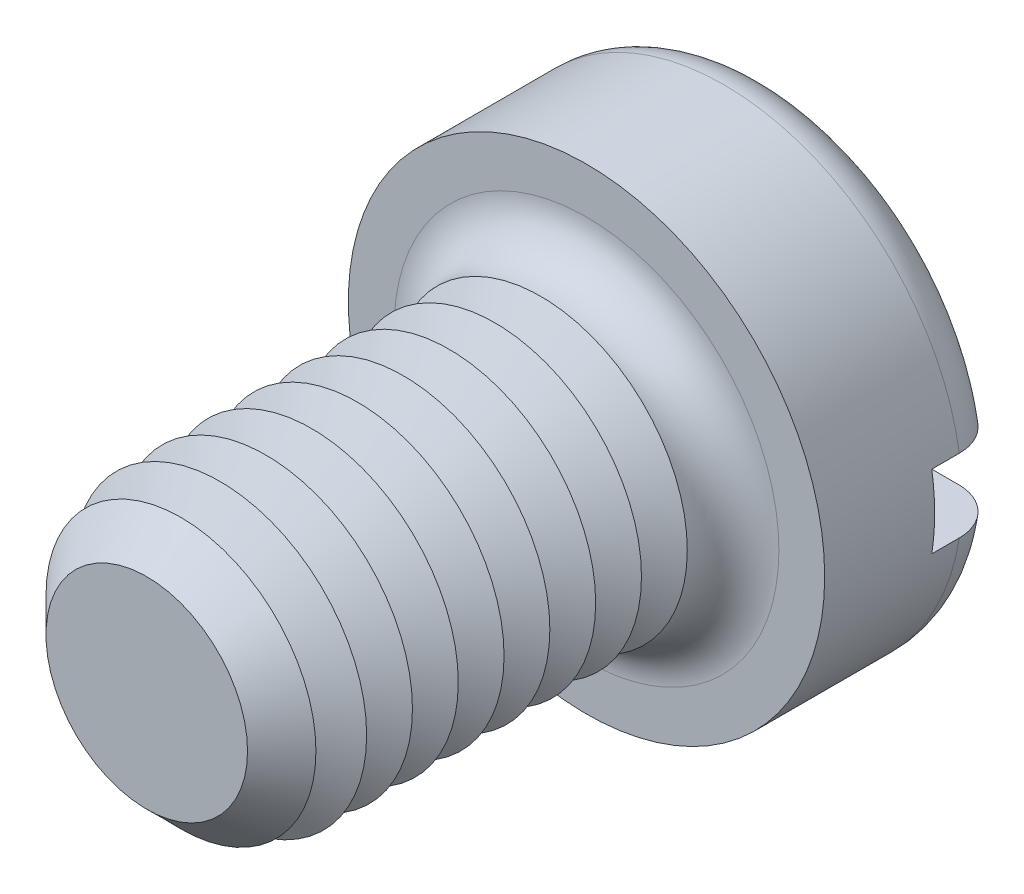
from build123d import *

# Parameters (mm, degrees)
SKETCH3_R           = 6.5
BOSS_EXTRUDE2_DEPTH = 5
SKETCH4_R           = 4
BOSS_EXTRUDE3_DEPTH = 12
FILLET1_R           = 1.25
CHAMFER1_SIZE       = 1.25
LPATTERN1_COUNT     = 8
LPATTERN1_PITCH     = 1.25
SKETCH8_W           = 13
SKETCH8_H           = 2
CUT_EXTRUDE1_DEPTH  = 2


with BuildPart() as part:
    # Sketch3 → Boss-Extrude2 (new body)
    with BuildSketch(Plane.XY):
        Circle(SKETCH3_R)
    extrude(amount=-BOSS_EXTRUDE2_DEPTH)

    # Sketch4 → Boss-Extrude3 (add)
    with BuildSketch(Plane.XY):
        Circle(SKETCH4_R)
    extrude(amount=BOSS_EXTRUDE3_DEPTH)

    # Fillet1
    fillet1_edges = [part.edges().sort_by_distance(p)[0] for p in [
        (-6.5, 0, -5),
        (-4, 0, 0),
    ]]
    fillet(fillet1_edges, radius=FILLET1_R)

    # Chamfer1
    chamfer1_edges = [part.edges().sort_by_distance(p)[0] for p in [
        (-4, 0, 12),
    ]]
    chamfer(chamfer1_edges, length=CHAMFER1_SIZE)

    # Sketch6 → Cut-Revolve1 (revolve, cut)
    with BuildSketch(Plane(origin=(0, 0, 0), x_dir=(0, 0, -1), z_dir=(1, 0, 0)), mode=Mode.PRIVATE) as cut_revolve1_sk:
        Polygon((-1.25, 4), (-1.875, 2.917468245), (-2.5, 4), align=None)
    cut_revolve1 = revolve(cut_revolve1_sk.sketch.rotate(Axis((0, 0, -1.694361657), (0, 0, 1)), 90), axis=Axis((0, 0, -1.694361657), (0, 0, 1)), mode=Mode.SUBTRACT)

    # LPattern1: Cut-Revolve1 ×8
    with Locations(*[(0, 0, i * LPATTERN1_PITCH) for i in range(1, LPATTERN1_COUNT)]):
        add(cut_revolve1, mode=Mode.SUBTRACT)

    # Sketch8 → Cut-Extrude1 (cut)
    with BuildSketch(Plane(origin=(0, 0, -5), x_dir=(-1, 0, 0), z_dir=(0, 0, -1))):
        Rectangle(SKETCH8_W, SKETCH8_H)
    extrude(amount=-CUT_EXTRUDE1_DEPTH, mode=Mode.SUBTRACT)


solid = part.part
